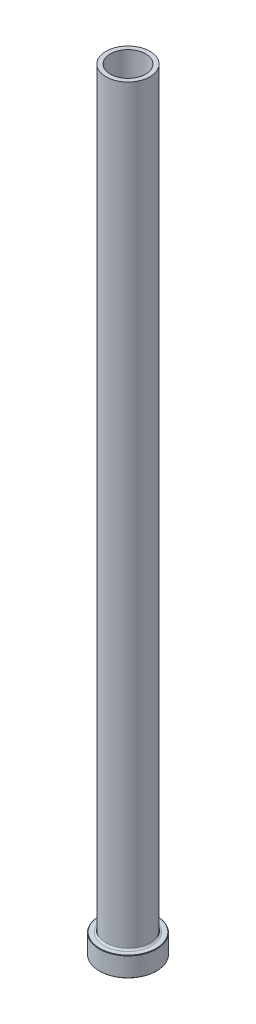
from build123d import *

# Parameters (mm, degrees)
FILLET1_R     = 0.8
CHAMFER1_SIZE = 0.2
CHAMFER3_SIZE = 0.5


with BuildPart() as part:
    # Sketch1 → Revolve1 (revolve)
    with BuildSketch(Plane.XY, mode=Mode.PRIVATE) as revolve1_sk:
        Polygon((-8, 350), (-10, 350), (-10, 9), (-13, 9), (-13, 0), (-8.25, 0), (-8.25, 283), (-8, 295), align=None)
    revolve(revolve1_sk.sketch.rotate(Axis((0, 92.187680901, 0), (0, -1, 0)), 270), axis=Axis((0, 92.187680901, 0), (0, -1, 0)))

    # Fillet1
    fillet1_edges = [part.edges().sort_by_distance(p)[0] for p in [
        (0, 9, -10),
    ]]
    fillet(fillet1_edges, radius=FILLET1_R)

    # Chamfer1
    chamfer1_edges = [part.edges().sort_by_distance(p)[0] for p in [
        (0, 0, -13),
        (0, 9, -13),
    ]]
    chamfer(chamfer1_edges, length=CHAMFER1_SIZE)

    # Chamfer3
    chamfer3_edges = [part.edges().sort_by_distance(p)[0] for p in [
        (0, 0, -8.25),
    ]]
    chamfer(chamfer3_edges, length=CHAMFER3_SIZE)


solid = part.part
